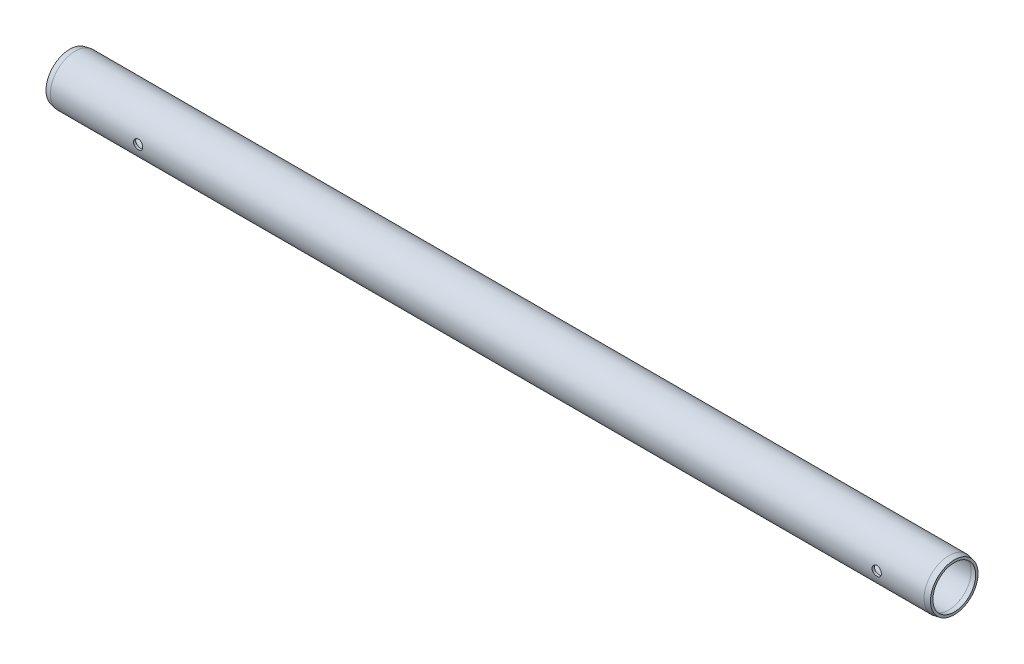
from build123d import *

# Parameters (mm, degrees)
ESQUISSE2_R             = 1.5
ENL_V_MAT_EXTRU_1_DEPTH = 15


with BuildPart() as part:
    # Esquisse1 → R_volution1 (revolve)
    with BuildSketch(Plane.XY, mode=Mode.PRIVATE) as r_volution1_sk:
        Polygon((1.814053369, 7.25), (142.5, 7.25), (142.5, 8), (1.740983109, 8), (0, 7.65751152), (0.000623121, 6.893259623), align=None)
    revolve(r_volution1_sk.sketch.rotate(Axis((0, 0, 0), (1, 0, 0)), 90), axis=Axis((0, 0, 0), (1, 0, 0)))

    # Sym_trie1: part across plane


with BuildPart() as part_1:
    add(part.part)
    add(part.part.mirror(Plane(origin=(142.5, 7.25, 0), x_dir=(0, 0, 1), z_dir=(-1, 0, 0))))

    # Esquisse2 → Enl_v. mat.-Extru.1 (cut, symmetric)
    with BuildSketch(Plane.XY):
        with Locations((30, 0)):
            Circle(ESQUISSE2_R)
        with Locations((268, 0)):
            Circle(ESQUISSE2_R)
    extrude(amount=ENL_V_MAT_EXTRU_1_DEPTH, both=True, mode=Mode.SUBTRACT)


solid = part_1.part
